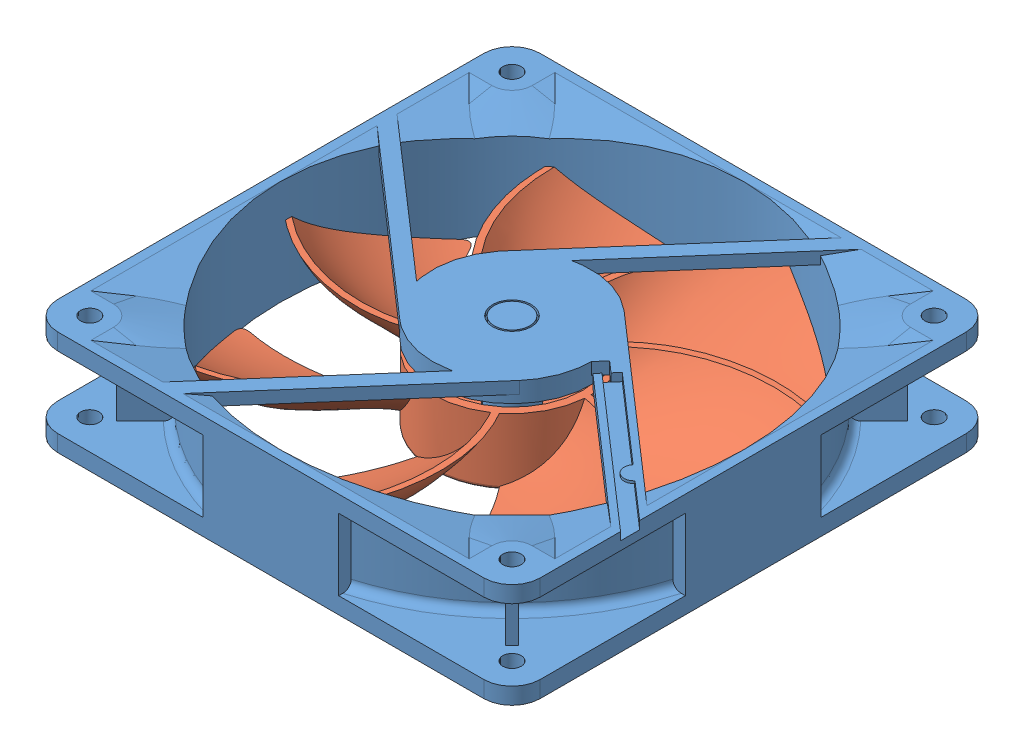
SolidWorks assembly fan.SLDASM, configuration Default (file format 9000). Lengths in mm.
Overall size (120.35 26 120).
2 component instances, 2 part files, 2 mates.
Components (placement in the parent):
- fan-1: fan.SLDPRT [Default] at (-72.9248 -24.3543 46.1954) size (120 26 120)
- fan blade-1: fan blade.SLDPRT [Default] at (-72.9249 -2.9554 46.1954) x (0 0 -1) z (-1 0 0) size (117.73 20.15 117.78)
Mates (geometry in assembly coordinates):
- Concentric1: concentric anti-aligned: cylinder of fan-1 through (-72.9248 -37.3543 46.1954) axis (0 1 0) radius 1.4328; cylinder of fan blade-1 through (-72.9248 -3.1703 46.1954) axis (0 -1 0) radius 1.4329
- Coincident1: coincident anti-aligned: plane of fan-1 through (-72.9248 -17.3543 46.1954) normal (0 -1 0); plane of fan blade-1 through (-72.9248 -17.3543 46.1954) normal (0 1 0)
